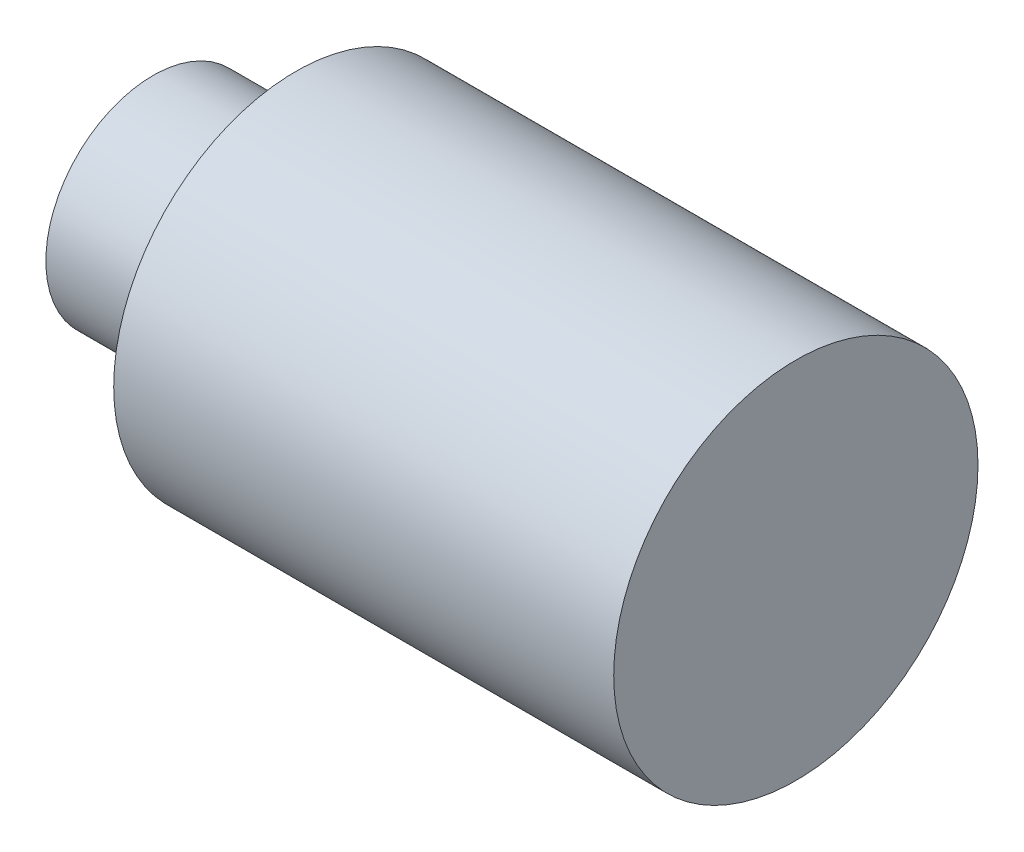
ISO-10303-21;
HEADER;
FILE_DESCRIPTION(('STEP AP214'),'2;1');
FILE_NAME('part.step','',(''),(''),'','','');
FILE_SCHEMA(('AUTOMOTIVE_DESIGN { 1 0 10303 214 1 1 1 1 }'));
ENDSEC;
DATA;
#1=APPLICATION_CONTEXT('core data for automotive mechanical design processes');
#2=APPLICATION_PROTOCOL_DEFINITION('international standard','automotive_design',2000,#1);
#3=PRODUCT_CONTEXT('',#1,'mechanical');
#4=PRODUCT('Part','Part','',(#3));
#5=PRODUCT_RELATED_PRODUCT_CATEGORY('part','',(#4));
#6=PRODUCT_DEFINITION_FORMATION('','',#4);
#7=PRODUCT_DEFINITION_CONTEXT('part definition',#1,'design');
#8=PRODUCT_DEFINITION('design','',#6,#7);
#9=PRODUCT_DEFINITION_SHAPE('','',#8);
#10=(LENGTH_UNIT() NAMED_UNIT(*) SI_UNIT(.MILLI.,.METRE.));
#11=(NAMED_UNIT(*) PLANE_ANGLE_UNIT() SI_UNIT($,.RADIAN.));
#12=(NAMED_UNIT(*) SI_UNIT($,.STERADIAN.) SOLID_ANGLE_UNIT());
#13=UNCERTAINTY_MEASURE_WITH_UNIT(LENGTH_MEASURE(1.E-05),#10,'distance_accuracy_value','');
#14=(GEOMETRIC_REPRESENTATION_CONTEXT(3) GLOBAL_UNCERTAINTY_ASSIGNED_CONTEXT((#13)) GLOBAL_UNIT_ASSIGNED_CONTEXT((#10,
#11,#12)) REPRESENTATION_CONTEXT('',''));
#15=CARTESIAN_POINT('',(0.,0.,0.));
#16=DIRECTION('',(0.,0.,1.));
#17=DIRECTION('',(1.,0.,0.));
#18=AXIS2_PLACEMENT_3D('',#15,#16,#17);
#19=CARTESIAN_POINT('',(2.,0.,0.));
#20=DIRECTION('',(-1.,0.,0.));
#21=DIRECTION('',(0.,0.,1.));
#22=AXIS2_PLACEMENT_3D('',#19,#20,#21);
#23=CYLINDRICAL_SURFACE('',#22,1.5);
#24=CARTESIAN_POINT('',(2.,0.,0.));
#25=DIRECTION('',(1.,0.,0.));
#26=DIRECTION('',(0.,0.,-1.));
#27=AXIS2_PLACEMENT_3D('',#24,#25,#26);
#28=CIRCLE('',#27,1.5);
#29=CARTESIAN_POINT('',(2.,0.,-1.5));
#30=VERTEX_POINT('',#29);
#31=EDGE_CURVE('E10',#30,#30,#28,.T.);
#32=ORIENTED_EDGE('',*,*,#31,.F.);
#33=EDGE_LOOP('',(#32));
#34=FACE_BOUND('',#33,.T.);
#35=CARTESIAN_POINT('',(0.,0.,0.));
#36=DIRECTION('',(1.,0.,0.));
#37=DIRECTION('',(0.,0.,-1.));
#38=AXIS2_PLACEMENT_3D('',#35,#36,#37);
#39=CIRCLE('',#38,1.5);
#40=CARTESIAN_POINT('',(0.,0.,-1.5));
#41=VERTEX_POINT('',#40);
#42=EDGE_CURVE('E36',#41,#41,#39,.T.);
#43=ORIENTED_EDGE('',*,*,#42,.T.);
#44=EDGE_LOOP('',(#43));
#45=FACE_BOUND('',#44,.T.);
#46=ADVANCED_FACE('F33',(#34,#45),#23,.T.);
#47=CARTESIAN_POINT('',(0.,0.,0.));
#48=DIRECTION('',(1.,0.,0.));
#49=DIRECTION('',(0.,0.,-1.));
#50=AXIS2_PLACEMENT_3D('',#47,#48,#49);
#51=PLANE('',#50);
#52=ORIENTED_EDGE('',*,*,#42,.F.);
#53=EDGE_LOOP('',(#52));
#54=FACE_BOUND('',#53,.T.);
#55=ADVANCED_FACE('F61',(#54),#51,.F.);
#56=CARTESIAN_POINT('',(2.,0.,0.));
#57=DIRECTION('',(1.,0.,0.));
#58=DIRECTION('',(0.,0.,-1.));
#59=AXIS2_PLACEMENT_3D('',#56,#57,#58);
#60=PLANE('',#59);
#61=CARTESIAN_POINT('',(2.,0.,0.));
#62=DIRECTION('',(1.,0.,0.));
#63=DIRECTION('',(0.,0.,-1.));
#64=AXIS2_PLACEMENT_3D('',#61,#62,#63);
#65=CIRCLE('',#64,2.55);
#66=CARTESIAN_POINT('',(2.,0.,-2.55));
#67=VERTEX_POINT('',#66);
#68=EDGE_CURVE('E45',#67,#67,#65,.T.);
#69=ORIENTED_EDGE('',*,*,#68,.F.);
#70=EDGE_LOOP('',(#69));
#71=FACE_BOUND('',#70,.T.);
#72=ORIENTED_EDGE('',*,*,#31,.T.);
#73=EDGE_LOOP('',(#72));
#74=FACE_BOUND('',#73,.T.);
#75=ADVANCED_FACE('F56',(#71,#74),#60,.F.);
#76=CARTESIAN_POINT('',(9.,0.,0.));
#77=DIRECTION('',(-1.,0.,0.));
#78=DIRECTION('',(0.,0.,1.));
#79=AXIS2_PLACEMENT_3D('',#76,#77,#78);
#80=CYLINDRICAL_SURFACE('',#79,2.55);
#81=CARTESIAN_POINT('',(9.,0.,0.));
#82=DIRECTION('',(1.,0.,0.));
#83=DIRECTION('',(0.,0.,-1.));
#84=AXIS2_PLACEMENT_3D('',#81,#82,#83);
#85=CIRCLE('',#84,2.55);
#86=CARTESIAN_POINT('',(9.,0.,-2.55));
#87=VERTEX_POINT('',#86);
#88=EDGE_CURVE('E43',#87,#87,#85,.T.);
#89=ORIENTED_EDGE('',*,*,#88,.F.);
#90=EDGE_LOOP('',(#89));
#91=FACE_BOUND('',#90,.T.);
#92=ORIENTED_EDGE('',*,*,#68,.T.);
#93=EDGE_LOOP('',(#92));
#94=FACE_BOUND('',#93,.T.);
#95=ADVANCED_FACE('F53',(#91,#94),#80,.T.);
#96=CARTESIAN_POINT('',(9.,0.,0.));
#97=DIRECTION('',(1.,0.,0.));
#98=DIRECTION('',(0.,0.,-1.));
#99=AXIS2_PLACEMENT_3D('',#96,#97,#98);
#100=PLANE('',#99);
#101=ORIENTED_EDGE('',*,*,#88,.T.);
#102=EDGE_LOOP('',(#101));
#103=FACE_BOUND('',#102,.T.);
#104=ADVANCED_FACE('F51',(#103),#100,.T.);
#105=CLOSED_SHELL('',(#46,#55,#75,#95,#104));
#106=MANIFOLD_SOLID_BREP('B2',#105);
#107=ADVANCED_BREP_SHAPE_REPRESENTATION('',(#18,#106),#14);
#108=SHAPE_DEFINITION_REPRESENTATION(#9,#107);
ENDSEC;
END-ISO-10303-21;
